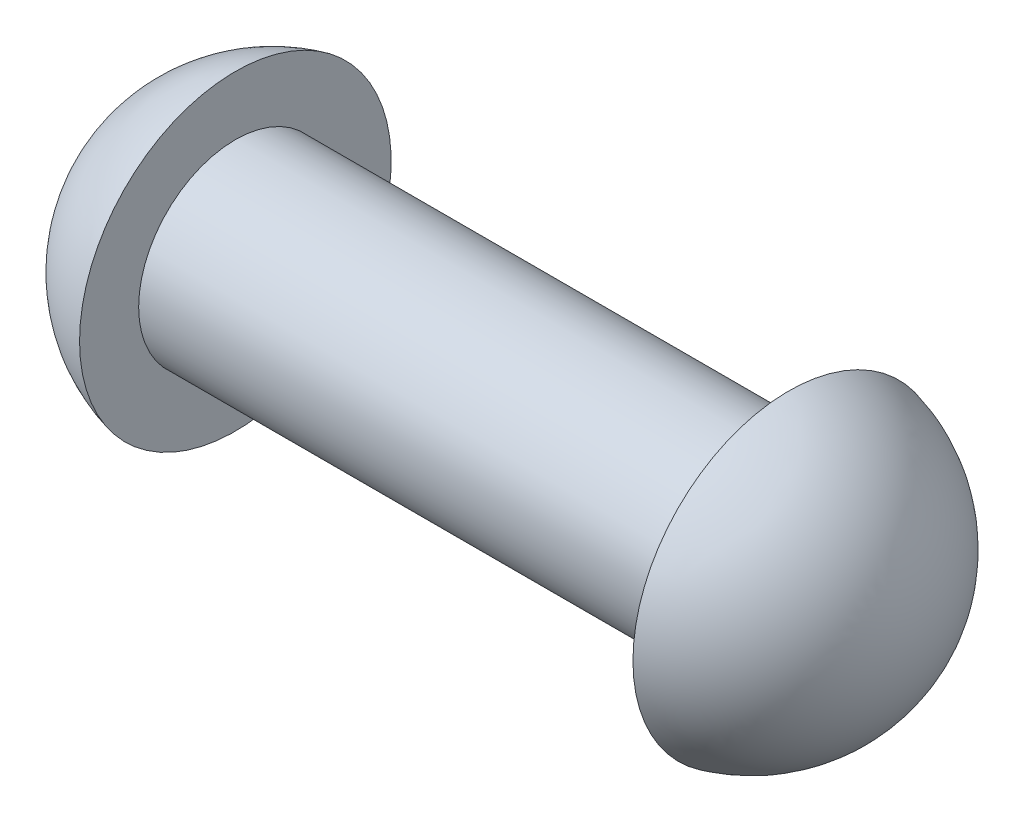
ISO-10303-21;
HEADER;
FILE_DESCRIPTION(('STEP AP214'),'2;1');
FILE_NAME('part.step','',(''),(''),'','','');
FILE_SCHEMA(('AUTOMOTIVE_DESIGN { 1 0 10303 214 1 1 1 1 }'));
ENDSEC;
DATA;
#1=APPLICATION_CONTEXT('core data for automotive mechanical design processes');
#2=APPLICATION_PROTOCOL_DEFINITION('international standard','automotive_design',2000,#1);
#3=PRODUCT_CONTEXT('',#1,'mechanical');
#4=PRODUCT('Part','Part','',(#3));
#5=PRODUCT_RELATED_PRODUCT_CATEGORY('part','',(#4));
#6=PRODUCT_DEFINITION_FORMATION('','',#4);
#7=PRODUCT_DEFINITION_CONTEXT('part definition',#1,'design');
#8=PRODUCT_DEFINITION('design','',#6,#7);
#9=PRODUCT_DEFINITION_SHAPE('','',#8);
#10=(LENGTH_UNIT() NAMED_UNIT(*) SI_UNIT(.MILLI.,.METRE.));
#11=(NAMED_UNIT(*) PLANE_ANGLE_UNIT() SI_UNIT($,.RADIAN.));
#12=(NAMED_UNIT(*) SI_UNIT($,.STERADIAN.) SOLID_ANGLE_UNIT());
#13=UNCERTAINTY_MEASURE_WITH_UNIT(LENGTH_MEASURE(1.E-05),#10,'distance_accuracy_value','');
#14=(GEOMETRIC_REPRESENTATION_CONTEXT(3) GLOBAL_UNCERTAINTY_ASSIGNED_CONTEXT((#13)) GLOBAL_UNIT_ASSIGNED_CONTEXT((#10,
#11,#12)) REPRESENTATION_CONTEXT('',''));
#15=CARTESIAN_POINT('',(0.,0.,0.));
#16=DIRECTION('',(0.,0.,1.));
#17=DIRECTION('',(1.,0.,0.));
#18=AXIS2_PLACEMENT_3D('',#15,#16,#17);
#19=CARTESIAN_POINT('',(-138.,0.,0.));
#20=DIRECTION('',(-1.,0.,0.));
#21=DIRECTION('',(0.,0.,1.));
#22=AXIS2_PLACEMENT_3D('',#19,#20,#21);
#23=CYLINDRICAL_SURFACE('',#22,18.);
#24=CARTESIAN_POINT('',(-103.,0.,0.));
#25=DIRECTION('',(-1.,0.,0.));
#26=DIRECTION('',(0.,0.,1.));
#27=AXIS2_PLACEMENT_3D('',#24,#25,#26);
#28=CIRCLE('',#27,18.);
#29=CARTESIAN_POINT('',(-103.,0.,18.));
#30=VERTEX_POINT('',#29);
#31=EDGE_CURVE('E11',#30,#30,#28,.T.);
#32=ORIENTED_EDGE('',*,*,#31,.F.);
#33=EDGE_LOOP('',(#32));
#34=FACE_BOUND('',#33,.T.);
#35=CARTESIAN_POINT('',(0.,0.,0.));
#36=DIRECTION('',(1.,0.,0.));
#37=DIRECTION('',(0.,0.,-1.));
#38=AXIS2_PLACEMENT_3D('',#35,#36,#37);
#39=CIRCLE('',#38,18.);
#40=CARTESIAN_POINT('',(0.,0.,-18.));
#41=VERTEX_POINT('',#40);
#42=EDGE_CURVE('E69',#41,#41,#39,.T.);
#43=ORIENTED_EDGE('',*,*,#42,.F.);
#44=EDGE_LOOP('',(#43));
#45=FACE_BOUND('',#44,.T.);
#46=ADVANCED_FACE('F33',(#34,#45),#23,.T.);
#47=CARTESIAN_POINT('',(-103.,18.,0.));
#48=DIRECTION('',(-1.,0.,0.));
#49=DIRECTION('',(0.,0.,1.));
#50=AXIS2_PLACEMENT_3D('',#47,#48,#49);
#51=PLANE('',#50);
#52=CARTESIAN_POINT('',(-103.,0.,0.));
#53=DIRECTION('',(-1.,0.,0.));
#54=DIRECTION('',(0.,0.,1.));
#55=AXIS2_PLACEMENT_3D('',#52,#53,#54);
#56=CIRCLE('',#55,29.);
#57=CARTESIAN_POINT('',(-103.,0.,29.));
#58=VERTEX_POINT('',#57);
#59=EDGE_CURVE('E40',#58,#58,#56,.T.);
#60=ORIENTED_EDGE('',*,*,#59,.F.);
#61=EDGE_LOOP('',(#60));
#62=FACE_BOUND('',#61,.T.);
#63=ORIENTED_EDGE('',*,*,#31,.T.);
#64=EDGE_LOOP('',(#63));
#65=FACE_BOUND('',#64,.T.);
#66=ADVANCED_FACE('F59',(#62,#65),#51,.F.);
#67=CARTESIAN_POINT('',(-96.0004932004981,0.,-0.172022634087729));
#68=DIRECTION('',(0.,-1.,0.));
#69=DIRECTION('',(0.,0.,1.));
#70=AXIS2_PLACEMENT_3D('',#67,#68,#69);
#71=CIRCLE('',#70,30.);
#72=TRIMMED_CURVE('',#71,(PARAMETER_VALUE(-1.56506220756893)),
(PARAMETER_VALUE(1.56506220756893)),.T.,.PARAMETER.);
#73=CARTESIAN_POINT('',(-96.0004932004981,0.,0.));
#74=DIRECTION('',(-1.,0.,0.));
#75=AXIS1_PLACEMENT('',#73,#74);
#76=SURFACE_OF_REVOLUTION('',#72,#75);
#77=CARTESIAN_POINT('',(-126.,0.,0.));
#78=VERTEX_POINT('',#77);
#79=VERTEX_LOOP('',#78);
#80=FACE_BOUND('',#79,.T.);
#81=ORIENTED_EDGE('',*,*,#59,.T.);
#82=EDGE_LOOP('',(#81));
#83=FACE_BOUND('',#82,.T.);
#84=ADVANCED_FACE('F54',(#80,#83),#76,.T.);
#85=CARTESIAN_POINT('',(0.,0.,0.));
#86=DIRECTION('',(1.,0.,0.));
#87=DIRECTION('',(0.,0.,-1.));
#88=AXIS2_PLACEMENT_3D('',#85,#86,#87);
#89=PLANE('',#88);
#90=CARTESIAN_POINT('',(0.,0.,0.));
#91=DIRECTION('',(-1.,0.,0.));
#92=DIRECTION('',(0.,0.,1.));
#93=AXIS2_PLACEMENT_3D('',#90,#91,#92);
#94=CIRCLE('',#93,29.);
#95=CARTESIAN_POINT('',(0.,0.,29.));
#96=VERTEX_POINT('',#95);
#97=EDGE_CURVE('E71',#96,#96,#94,.T.);
#98=ORIENTED_EDGE('',*,*,#97,.T.);
#99=EDGE_LOOP('',(#98));
#100=FACE_BOUND('',#99,.T.);
#101=ORIENTED_EDGE('',*,*,#42,.T.);
#102=EDGE_LOOP('',(#101));
#103=FACE_BOUND('',#102,.T.);
#104=ADVANCED_FACE('F48',(#100,#103),#89,.F.);
#105=CARTESIAN_POINT('',(-6.99950679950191,0.,-0.172022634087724));
#106=DIRECTION('',(0.,-1.,0.));
#107=DIRECTION('',(0.,0.,1.));
#108=AXIS2_PLACEMENT_3D('',#105,#106,#107);
#109=CIRCLE('',#108,30.);
#110=TRIMMED_CURVE('',#109,(PARAMETER_VALUE(-1.56506220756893)),
(PARAMETER_VALUE(1.56506220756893)),.T.,.PARAMETER.);
#111=CARTESIAN_POINT('',(-6.99950679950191,0.,0.));
#112=DIRECTION('',(-1.,0.,0.));
#113=AXIS1_PLACEMENT('',#111,#112);
#114=SURFACE_OF_REVOLUTION('',#110,#113);
#115=ORIENTED_EDGE('',*,*,#97,.F.);
#116=EDGE_LOOP('',(#115));
#117=FACE_BOUND('',#116,.T.);
#118=CARTESIAN_POINT('',(23.,0.,0.));
#119=VERTEX_POINT('',#118);
#120=VERTEX_LOOP('',#119);
#121=FACE_BOUND('',#120,.T.);
#122=ADVANCED_FACE('F46',(#117,#121),#114,.T.);
#123=CLOSED_SHELL('',(#46,#66,#84,#104,#122));
#124=MANIFOLD_SOLID_BREP('B2',#123);
#125=ADVANCED_BREP_SHAPE_REPRESENTATION('',(#18,#124),#14);
#126=SHAPE_DEFINITION_REPRESENTATION(#9,#125);
ENDSEC;
END-ISO-10303-21;
